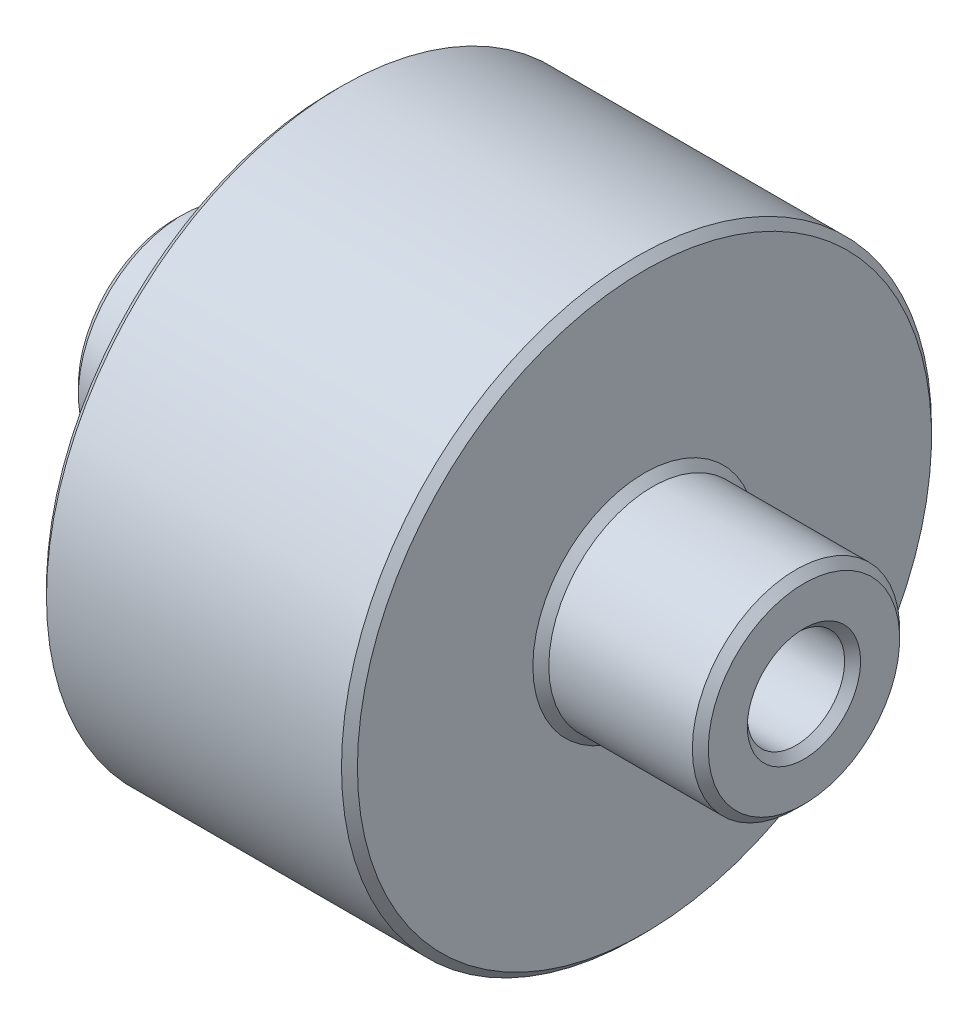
ISO-10303-21;
HEADER;
FILE_DESCRIPTION(('STEP AP214'),'2;1');
FILE_NAME('part.step','',(''),(''),'','','');
FILE_SCHEMA(('AUTOMOTIVE_DESIGN { 1 0 10303 214 1 1 1 1 }'));
ENDSEC;
DATA;
#1=APPLICATION_CONTEXT('core data for automotive mechanical design processes');
#2=APPLICATION_PROTOCOL_DEFINITION('international standard','automotive_design',2000,#1);
#3=PRODUCT_CONTEXT('',#1,'mechanical');
#4=PRODUCT('Part','Part','',(#3));
#5=PRODUCT_RELATED_PRODUCT_CATEGORY('part','',(#4));
#6=PRODUCT_DEFINITION_FORMATION('','',#4);
#7=PRODUCT_DEFINITION_CONTEXT('part definition',#1,'design');
#8=PRODUCT_DEFINITION('design','',#6,#7);
#9=PRODUCT_DEFINITION_SHAPE('','',#8);
#10=(LENGTH_UNIT() NAMED_UNIT(*) SI_UNIT(.MILLI.,.METRE.));
#11=(NAMED_UNIT(*) PLANE_ANGLE_UNIT() SI_UNIT($,.RADIAN.));
#12=(NAMED_UNIT(*) SI_UNIT($,.STERADIAN.) SOLID_ANGLE_UNIT());
#13=UNCERTAINTY_MEASURE_WITH_UNIT(LENGTH_MEASURE(1.E-05),#10,'distance_accuracy_value','');
#14=(GEOMETRIC_REPRESENTATION_CONTEXT(3) GLOBAL_UNCERTAINTY_ASSIGNED_CONTEXT((#13)) GLOBAL_UNIT_ASSIGNED_CONTEXT((#10,
#11,#12)) REPRESENTATION_CONTEXT('',''));
#15=CARTESIAN_POINT('',(0.,0.,0.));
#16=DIRECTION('',(0.,0.,1.));
#17=DIRECTION('',(1.,0.,0.));
#18=AXIS2_PLACEMENT_3D('',#15,#16,#17);
#19=CARTESIAN_POINT('',(0.,6.5,0.));
#20=DIRECTION('',(1.,0.,0.));
#21=DIRECTION('',(0.,0.,-1.));
#22=AXIS2_PLACEMENT_3D('',#19,#20,#21);
#23=PLANE('',#22);
#24=CARTESIAN_POINT('',(0.,0.,0.));
#25=DIRECTION('',(1.,0.,0.));
#26=DIRECTION('',(0.,0.,-1.));
#27=AXIS2_PLACEMENT_3D('',#24,#25,#26);
#28=CIRCLE('',#27,6.00000000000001);
#29=CARTESIAN_POINT('',(0.,0.,-6.00000000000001));
#30=VERTEX_POINT('',#29);
#31=EDGE_CURVE('E54',#30,#30,#28,.F.);
#32=ORIENTED_EDGE('',*,*,#31,.T.);
#33=EDGE_LOOP('',(#32));
#34=FACE_BOUND('',#33,.T.);
#35=CARTESIAN_POINT('',(0.,0.,0.));
#36=DIRECTION('',(1.,0.,0.));
#37=DIRECTION('',(0.,0.,-1.));
#38=AXIS2_PLACEMENT_3D('',#35,#36,#37);
#39=CIRCLE('',#38,3.55);
#40=CARTESIAN_POINT('',(0.,0.,-3.55));
#41=VERTEX_POINT('',#40);
#42=EDGE_CURVE('E57',#41,#41,#39,.T.);
#43=ORIENTED_EDGE('',*,*,#42,.T.);
#44=EDGE_LOOP('',(#43));
#45=FACE_BOUND('',#44,.T.);
#46=ADVANCED_FACE('F28',(#34,#45),#23,.F.);
#47=CARTESIAN_POINT('',(0.,0.,0.));
#48=DIRECTION('',(-1.,0.,0.));
#49=DIRECTION('',(0.,0.,1.));
#50=AXIS2_PLACEMENT_3D('',#47,#48,#49);
#51=CYLINDRICAL_SURFACE('',#50,3.05);
#52=CARTESIAN_POINT('',(0.499999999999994,0.,0.));
#53=DIRECTION('',(1.,0.,0.));
#54=DIRECTION('',(0.,0.,-1.));
#55=AXIS2_PLACEMENT_3D('',#52,#53,#54);
#56=CIRCLE('',#55,3.05);
#57=CARTESIAN_POINT('',(0.499999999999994,0.,-3.05));
#58=VERTEX_POINT('',#57);
#59=EDGE_CURVE('E10',#58,#58,#56,.F.);
#60=ORIENTED_EDGE('',*,*,#59,.T.);
#61=EDGE_LOOP('',(#60));
#62=FACE_BOUND('',#61,.T.);
#63=CARTESIAN_POINT('',(39.,0.,0.));
#64=DIRECTION('',(-1.,0.,0.));
#65=DIRECTION('',(0.,0.,1.));
#66=AXIS2_PLACEMENT_3D('',#63,#64,#65);
#67=CIRCLE('',#66,3.05);
#68=CARTESIAN_POINT('',(39.,0.,3.05));
#69=VERTEX_POINT('',#68);
#70=EDGE_CURVE('E35',#69,#69,#67,.F.);
#71=ORIENTED_EDGE('',*,*,#70,.T.);
#72=EDGE_LOOP('',(#71));
#73=FACE_BOUND('',#72,.T.);
#74=ADVANCED_FACE('F121',(#62,#73),#51,.F.);
#75=CARTESIAN_POINT('',(39.5,3.05,0.));
#76=DIRECTION('',(-1.,0.,0.));
#77=DIRECTION('',(0.,0.,1.));
#78=AXIS2_PLACEMENT_3D('',#75,#76,#77);
#79=PLANE('',#78);
#80=CARTESIAN_POINT('',(39.5,0.,0.));
#81=DIRECTION('',(-1.,0.,0.));
#82=DIRECTION('',(0.,0.,1.));
#83=AXIS2_PLACEMENT_3D('',#80,#81,#82);
#84=CIRCLE('',#83,5.99999999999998);
#85=CARTESIAN_POINT('',(39.5,0.,5.99999999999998));
#86=VERTEX_POINT('',#85);
#87=EDGE_CURVE('E39',#86,#86,#84,.F.);
#88=ORIENTED_EDGE('',*,*,#87,.T.);
#89=EDGE_LOOP('',(#88));
#90=FACE_BOUND('',#89,.T.);
#91=CARTESIAN_POINT('',(39.5,0.,0.));
#92=DIRECTION('',(-1.,0.,0.));
#93=DIRECTION('',(0.,0.,1.));
#94=AXIS2_PLACEMENT_3D('',#91,#92,#93);
#95=CIRCLE('',#94,3.55);
#96=CARTESIAN_POINT('',(39.5,0.,3.55));
#97=VERTEX_POINT('',#96);
#98=EDGE_CURVE('E43',#97,#97,#95,.T.);
#99=ORIENTED_EDGE('',*,*,#98,.T.);
#100=EDGE_LOOP('',(#99));
#101=FACE_BOUND('',#100,.T.);
#102=ADVANCED_FACE('F145',(#90,#101),#79,.F.);
#103=CARTESIAN_POINT('',(0.,0.,0.));
#104=DIRECTION('',(-1.,0.,0.));
#105=DIRECTION('',(0.,0.,1.));
#106=AXIS2_PLACEMENT_3D('',#103,#104,#105);
#107=CYLINDRICAL_SURFACE('',#106,6.5);
#108=CARTESIAN_POINT('',(39.,0.,0.));
#109=DIRECTION('',(-1.,0.,0.));
#110=DIRECTION('',(0.,0.,1.));
#111=AXIS2_PLACEMENT_3D('',#108,#109,#110);
#112=CIRCLE('',#111,6.5);
#113=CARTESIAN_POINT('',(39.,0.,6.5));
#114=VERTEX_POINT('',#113);
#115=EDGE_CURVE('E48',#114,#114,#112,.T.);
#116=ORIENTED_EDGE('',*,*,#115,.T.);
#117=EDGE_LOOP('',(#116));
#118=FACE_BOUND('',#117,.T.);
#119=CARTESIAN_POINT('',(30.,0.,0.));
#120=DIRECTION('',(-1.,0.,0.));
#121=DIRECTION('',(0.,0.,1.));
#122=AXIS2_PLACEMENT_3D('',#119,#120,#121);
#123=CIRCLE('',#122,6.5);
#124=CARTESIAN_POINT('',(30.,0.,6.5));
#125=VERTEX_POINT('',#124);
#126=EDGE_CURVE('E51',#125,#125,#123,.F.);
#127=ORIENTED_EDGE('',*,*,#126,.T.);
#128=EDGE_LOOP('',(#127));
#129=FACE_BOUND('',#128,.T.);
#130=ADVANCED_FACE('F148',(#118,#129),#107,.T.);
#131=CARTESIAN_POINT('',(29.5,6.5,0.));
#132=DIRECTION('',(-1.,0.,0.));
#133=DIRECTION('',(0.,0.,1.));
#134=AXIS2_PLACEMENT_3D('',#131,#132,#133);
#135=PLANE('',#134);
#136=CARTESIAN_POINT('',(29.5,0.,0.));
#137=DIRECTION('',(-1.,0.,0.));
#138=DIRECTION('',(0.,0.,1.));
#139=AXIS2_PLACEMENT_3D('',#136,#137,#138);
#140=CIRCLE('',#139,18.);
#141=CARTESIAN_POINT('',(29.5,0.,18.));
#142=VERTEX_POINT('',#141);
#143=EDGE_CURVE('E72',#142,#142,#140,.F.);
#144=ORIENTED_EDGE('',*,*,#143,.T.);
#145=EDGE_LOOP('',(#144));
#146=FACE_BOUND('',#145,.T.);
#147=CARTESIAN_POINT('',(29.5,0.,0.));
#148=DIRECTION('',(-1.,0.,0.));
#149=DIRECTION('',(0.,0.,1.));
#150=AXIS2_PLACEMENT_3D('',#147,#148,#149);
#151=CIRCLE('',#150,7.00000000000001);
#152=CARTESIAN_POINT('',(29.5,0.,7.00000000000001));
#153=VERTEX_POINT('',#152);
#154=EDGE_CURVE('E75',#153,#153,#151,.T.);
#155=ORIENTED_EDGE('',*,*,#154,.T.);
#156=EDGE_LOOP('',(#155));
#157=FACE_BOUND('',#156,.T.);
#158=ADVANCED_FACE('F152',(#146,#157),#135,.F.);
#159=CARTESIAN_POINT('',(0.,0.,0.));
#160=DIRECTION('',(-1.,0.,0.));
#161=DIRECTION('',(0.,0.,1.));
#162=AXIS2_PLACEMENT_3D('',#159,#160,#161);
#163=CYLINDRICAL_SURFACE('',#162,18.5);
#164=CARTESIAN_POINT('',(29.,0.,0.));
#165=DIRECTION('',(-1.,0.,0.));
#166=DIRECTION('',(0.,0.,1.));
#167=AXIS2_PLACEMENT_3D('',#164,#165,#166);
#168=CIRCLE('',#167,18.5);
#169=CARTESIAN_POINT('',(29.,0.,18.5));
#170=VERTEX_POINT('',#169);
#171=EDGE_CURVE('E78',#170,#170,#168,.T.);
#172=ORIENTED_EDGE('',*,*,#171,.T.);
#173=EDGE_LOOP('',(#172));
#174=FACE_BOUND('',#173,.T.);
#175=CARTESIAN_POINT('',(10.5,0.,0.));
#176=DIRECTION('',(1.,0.,0.));
#177=DIRECTION('',(0.,0.,-1.));
#178=AXIS2_PLACEMENT_3D('',#175,#176,#177);
#179=CIRCLE('',#178,18.5);
#180=CARTESIAN_POINT('',(10.5,0.,-18.5));
#181=VERTEX_POINT('',#180);
#182=EDGE_CURVE('E81',#181,#181,#179,.T.);
#183=ORIENTED_EDGE('',*,*,#182,.T.);
#184=EDGE_LOOP('',(#183));
#185=FACE_BOUND('',#184,.T.);
#186=ADVANCED_FACE('F85',(#174,#185),#163,.T.);
#187=CARTESIAN_POINT('',(10.,18.5,0.));
#188=DIRECTION('',(1.,0.,0.));
#189=DIRECTION('',(0.,0.,-1.));
#190=AXIS2_PLACEMENT_3D('',#187,#188,#189);
#191=PLANE('',#190);
#192=CARTESIAN_POINT('',(10.,0.,0.));
#193=DIRECTION('',(1.,0.,0.));
#194=DIRECTION('',(0.,0.,-1.));
#195=AXIS2_PLACEMENT_3D('',#192,#193,#194);
#196=CIRCLE('',#195,18.);
#197=CARTESIAN_POINT('',(10.,0.,-18.));
#198=VERTEX_POINT('',#197);
#199=EDGE_CURVE('E66',#198,#198,#196,.F.);
#200=ORIENTED_EDGE('',*,*,#199,.T.);
#201=EDGE_LOOP('',(#200));
#202=FACE_BOUND('',#201,.T.);
#203=CARTESIAN_POINT('',(10.,0.,0.));
#204=DIRECTION('',(1.,0.,0.));
#205=DIRECTION('',(0.,0.,-1.));
#206=AXIS2_PLACEMENT_3D('',#203,#204,#205);
#207=CIRCLE('',#206,7.);
#208=CARTESIAN_POINT('',(10.,0.,-7.));
#209=VERTEX_POINT('',#208);
#210=EDGE_CURVE('E69',#209,#209,#207,.T.);
#211=ORIENTED_EDGE('',*,*,#210,.T.);
#212=EDGE_LOOP('',(#211));
#213=FACE_BOUND('',#212,.T.);
#214=ADVANCED_FACE('F95',(#202,#213),#191,.F.);
#215=CARTESIAN_POINT('',(0.,0.,0.));
#216=DIRECTION('',(-1.,0.,0.));
#217=DIRECTION('',(0.,0.,1.));
#218=AXIS2_PLACEMENT_3D('',#215,#216,#217);
#219=CYLINDRICAL_SURFACE('',#218,6.5);
#220=CARTESIAN_POINT('',(9.49999999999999,0.,0.));
#221=DIRECTION('',(1.,0.,0.));
#222=DIRECTION('',(0.,0.,-1.));
#223=AXIS2_PLACEMENT_3D('',#220,#221,#222);
#224=CIRCLE('',#223,6.5);
#225=CARTESIAN_POINT('',(9.49999999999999,0.,-6.5));
#226=VERTEX_POINT('',#225);
#227=EDGE_CURVE('E60',#226,#226,#224,.F.);
#228=ORIENTED_EDGE('',*,*,#227,.T.);
#229=EDGE_LOOP('',(#228));
#230=FACE_BOUND('',#229,.T.);
#231=CARTESIAN_POINT('',(0.499999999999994,0.,0.));
#232=DIRECTION('',(1.,0.,0.));
#233=DIRECTION('',(0.,0.,-1.));
#234=AXIS2_PLACEMENT_3D('',#231,#232,#233);
#235=CIRCLE('',#234,6.5);
#236=CARTESIAN_POINT('',(0.499999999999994,0.,-6.5));
#237=VERTEX_POINT('',#236);
#238=EDGE_CURVE('E63',#237,#237,#235,.T.);
#239=ORIENTED_EDGE('',*,*,#238,.T.);
#240=EDGE_LOOP('',(#239));
#241=FACE_BOUND('',#240,.T.);
#242=ADVANCED_FACE('F98',(#230,#241),#219,.T.);
#243=CARTESIAN_POINT('',(29.,0.,0.));
#244=DIRECTION('',(-1.,0.,0.));
#245=DIRECTION('',(0.,0.,1.));
#246=AXIS2_PLACEMENT_3D('',#243,#244,#245);
#247=CONICAL_SURFACE('',#246,18.5,0.785398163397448);
#248=ORIENTED_EDGE('',*,*,#143,.F.);
#249=EDGE_LOOP('',(#248));
#250=FACE_BOUND('',#249,.T.);
#251=ORIENTED_EDGE('',*,*,#171,.F.);
#252=EDGE_LOOP('',(#251));
#253=FACE_BOUND('',#252,.T.);
#254=ADVANCED_FACE('F91',(#250,#253),#247,.T.);
#255=CARTESIAN_POINT('',(10.,0.,0.));
#256=DIRECTION('',(1.,0.,0.));
#257=DIRECTION('',(0.,0.,-1.));
#258=AXIS2_PLACEMENT_3D('',#255,#256,#257);
#259=CONICAL_SURFACE('',#258,18.,0.785398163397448);
#260=ORIENTED_EDGE('',*,*,#182,.F.);
#261=EDGE_LOOP('',(#260));
#262=FACE_BOUND('',#261,.T.);
#263=ORIENTED_EDGE('',*,*,#199,.F.);
#264=EDGE_LOOP('',(#263));
#265=FACE_BOUND('',#264,.T.);
#266=ADVANCED_FACE('F87',(#262,#265),#259,.T.);
#267=CARTESIAN_POINT('',(9.49999999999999,0.,0.));
#268=DIRECTION('',(1.,0.,0.));
#269=DIRECTION('',(0.,0.,-1.));
#270=AXIS2_PLACEMENT_3D('',#267,#268,#269);
#271=CONICAL_SURFACE('',#270,6.5,0.78539816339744);
#272=ORIENTED_EDGE('',*,*,#210,.F.);
#273=EDGE_LOOP('',(#272));
#274=FACE_BOUND('',#273,.T.);
#275=ORIENTED_EDGE('',*,*,#227,.F.);
#276=EDGE_LOOP('',(#275));
#277=FACE_BOUND('',#276,.T.);
#278=ADVANCED_FACE('F90',(#274,#277),#271,.T.);
#279=CARTESIAN_POINT('',(0.,0.,0.));
#280=DIRECTION('',(1.,0.,0.));
#281=DIRECTION('',(0.,0.,-1.));
#282=AXIS2_PLACEMENT_3D('',#279,#280,#281);
#283=CONICAL_SURFACE('',#282,6.00000000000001,0.785398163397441);
#284=ORIENTED_EDGE('',*,*,#238,.F.);
#285=EDGE_LOOP('',(#284));
#286=FACE_BOUND('',#285,.T.);
#287=ORIENTED_EDGE('',*,*,#31,.F.);
#288=EDGE_LOOP('',(#287));
#289=FACE_BOUND('',#288,.T.);
#290=ADVANCED_FACE('F104',(#286,#289),#283,.T.);
#291=CARTESIAN_POINT('',(39.,0.,0.));
#292=DIRECTION('',(-1.,0.,0.));
#293=DIRECTION('',(0.,0.,1.));
#294=AXIS2_PLACEMENT_3D('',#291,#292,#293);
#295=CONICAL_SURFACE('',#294,6.5,0.785398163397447);
#296=ORIENTED_EDGE('',*,*,#87,.F.);
#297=EDGE_LOOP('',(#296));
#298=FACE_BOUND('',#297,.T.);
#299=ORIENTED_EDGE('',*,*,#115,.F.);
#300=EDGE_LOOP('',(#299));
#301=FACE_BOUND('',#300,.T.);
#302=ADVANCED_FACE('F115',(#298,#301),#295,.T.);
#303=CARTESIAN_POINT('',(29.5,0.,0.));
#304=DIRECTION('',(-1.,0.,0.));
#305=DIRECTION('',(0.,0.,1.));
#306=AXIS2_PLACEMENT_3D('',#303,#304,#305);
#307=CONICAL_SURFACE('',#306,7.00000000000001,0.785398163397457);
#308=ORIENTED_EDGE('',*,*,#126,.F.);
#309=EDGE_LOOP('',(#308));
#310=FACE_BOUND('',#309,.T.);
#311=ORIENTED_EDGE('',*,*,#154,.F.);
#312=EDGE_LOOP('',(#311));
#313=FACE_BOUND('',#312,.T.);
#314=ADVANCED_FACE('F128',(#310,#313),#307,.T.);
#315=CARTESIAN_POINT('',(0.499999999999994,0.,0.));
#316=DIRECTION('',(-1.,0.,0.));
#317=DIRECTION('',(0.,0.,1.));
#318=AXIS2_PLACEMENT_3D('',#315,#316,#317);
#319=CONICAL_SURFACE('',#318,3.05,0.785398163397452);
#320=ORIENTED_EDGE('',*,*,#42,.F.);
#321=EDGE_LOOP('',(#320));
#322=FACE_BOUND('',#321,.T.);
#323=ORIENTED_EDGE('',*,*,#59,.F.);
#324=EDGE_LOOP('',(#323));
#325=FACE_BOUND('',#324,.T.);
#326=ADVANCED_FACE('F125',(#322,#325),#319,.F.);
#327=CARTESIAN_POINT('',(39.5,0.,0.));
#328=DIRECTION('',(1.,0.,0.));
#329=DIRECTION('',(0.,0.,-1.));
#330=AXIS2_PLACEMENT_3D('',#327,#328,#329);
#331=CONICAL_SURFACE('',#330,3.55,0.785398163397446);
#332=ORIENTED_EDGE('',*,*,#70,.F.);
#333=EDGE_LOOP('',(#332));
#334=FACE_BOUND('',#333,.T.);
#335=ORIENTED_EDGE('',*,*,#98,.F.);
#336=EDGE_LOOP('',(#335));
#337=FACE_BOUND('',#336,.T.);
#338=ADVANCED_FACE('F30',(#334,#337),#331,.F.);
#339=CLOSED_SHELL('',(#46,#74,#102,#130,#158,#186,#214,#242,#254,#266,#278,#290,#302,#314,#326,#338));
#340=MANIFOLD_SOLID_BREP('B2',#339);
#341=ADVANCED_BREP_SHAPE_REPRESENTATION('',(#18,#340),#14);
#342=SHAPE_DEFINITION_REPRESENTATION(#9,#341);
ENDSEC;
END-ISO-10303-21;
